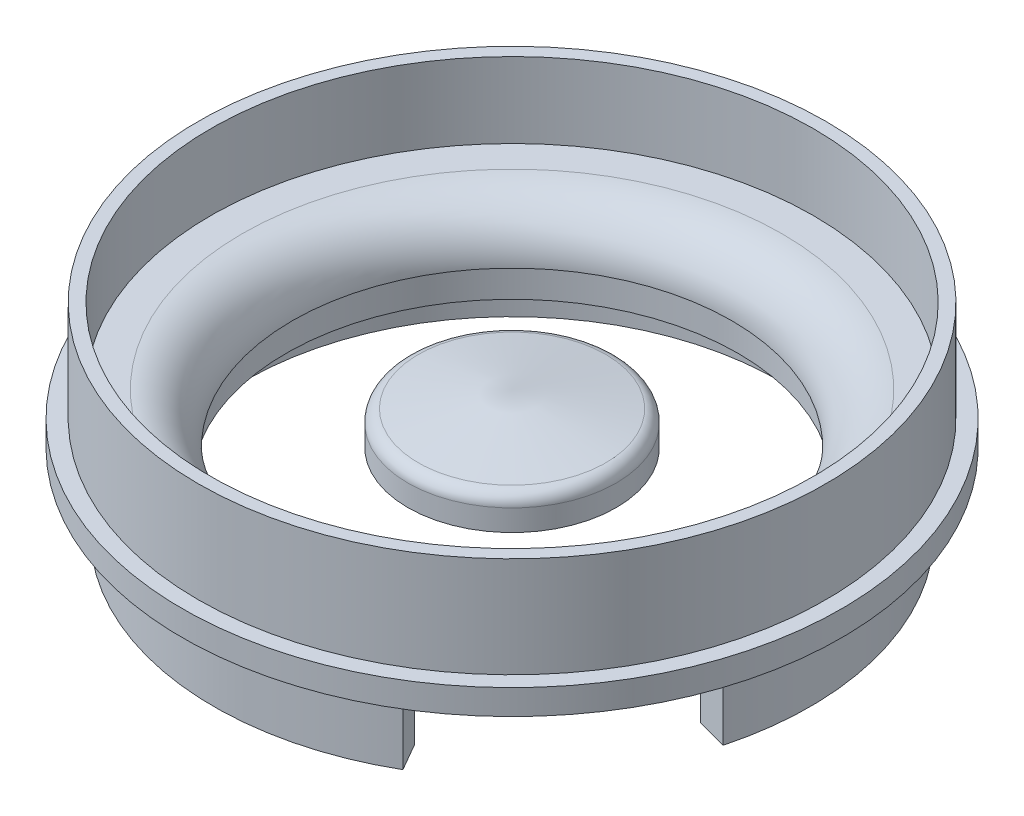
ISO-10303-21;
HEADER;
FILE_DESCRIPTION(('STEP AP214'),'2;1');
FILE_NAME('part.step','',(''),(''),'','','');
FILE_SCHEMA(('AUTOMOTIVE_DESIGN { 1 0 10303 214 1 1 1 1 }'));
ENDSEC;
DATA;
#1=APPLICATION_CONTEXT('core data for automotive mechanical design processes');
#2=APPLICATION_PROTOCOL_DEFINITION('international standard','automotive_design',2000,#1);
#3=PRODUCT_CONTEXT('',#1,'mechanical');
#4=PRODUCT('Part','Part','',(#3));
#5=PRODUCT_RELATED_PRODUCT_CATEGORY('part','',(#4));
#6=PRODUCT_DEFINITION_FORMATION('','',#4);
#7=PRODUCT_DEFINITION_CONTEXT('part definition',#1,'design');
#8=PRODUCT_DEFINITION('design','',#6,#7);
#9=PRODUCT_DEFINITION_SHAPE('','',#8);
#10=(LENGTH_UNIT() NAMED_UNIT(*) SI_UNIT(.MILLI.,.METRE.));
#11=(NAMED_UNIT(*) PLANE_ANGLE_UNIT() SI_UNIT($,.RADIAN.));
#12=(NAMED_UNIT(*) SI_UNIT($,.STERADIAN.) SOLID_ANGLE_UNIT());
#13=UNCERTAINTY_MEASURE_WITH_UNIT(LENGTH_MEASURE(1.E-05),#10,'distance_accuracy_value','');
#14=(GEOMETRIC_REPRESENTATION_CONTEXT(3) GLOBAL_UNCERTAINTY_ASSIGNED_CONTEXT((#13)) GLOBAL_UNIT_ASSIGNED_CONTEXT((#10,
#11,#12)) REPRESENTATION_CONTEXT('',''));
#15=CARTESIAN_POINT('',(0.,0.,0.));
#16=DIRECTION('',(0.,0.,1.));
#17=DIRECTION('',(1.,0.,0.));
#18=AXIS2_PLACEMENT_3D('',#15,#16,#17);
#19=CARTESIAN_POINT('',(0.,-12.,0.));
#20=DIRECTION('',(0.,1.,0.));
#21=DIRECTION('',(0.,0.,1.));
#22=AXIS2_PLACEMENT_3D('',#19,#20,#21);
#23=CYLINDRICAL_SURFACE('',#22,42.5);
#24=CARTESIAN_POINT('',(0.,0.,0.));
#25=DIRECTION('',(0.,-1.,0.));
#26=DIRECTION('',(0.,0.,-1.));
#27=AXIS2_PLACEMENT_3D('',#24,#25,#26);
#28=CIRCLE('',#27,42.5);
#29=CARTESIAN_POINT('',(21.2499999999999,0.,36.8060796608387));
#30=VERTEX_POINT('',#29);
#31=CARTESIAN_POINT('',(41.0518476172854,0.,10.9998094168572));
#32=VERTEX_POINT('',#31);
#33=EDGE_CURVE('E119',#30,#32,#28,.T.);
#34=ORIENTED_EDGE('',*,*,#33,.F.);
#35=DIRECTION('',(0.,1.,0.));
#36=VECTOR('',#35,1.);
#37=CARTESIAN_POINT('',(21.2499999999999,-12.,36.8060796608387));
#38=LINE('',#37,#36);
#39=CARTESIAN_POINT('',(21.2499999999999,-12.,36.8060796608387));
#40=VERTEX_POINT('',#39);
#41=EDGE_CURVE('E12',#40,#30,#38,.T.);
#42=ORIENTED_EDGE('',*,*,#41,.F.);
#43=CARTESIAN_POINT('',(0.,-12.,0.));
#44=DIRECTION('',(0.,-1.,0.));
#45=DIRECTION('',(0.,0.,-1.));
#46=AXIS2_PLACEMENT_3D('',#43,#44,#45);
#47=CIRCLE('',#46,42.5);
#48=CARTESIAN_POINT('',(41.0518476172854,-12.,10.9998094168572));
#49=VERTEX_POINT('',#48);
#50=EDGE_CURVE('E102',#40,#49,#47,.T.);
#51=ORIENTED_EDGE('',*,*,#50,.T.);
#52=DIRECTION('',(0.,1.,0.));
#53=VECTOR('',#52,1.);
#54=CARTESIAN_POINT('',(41.0518476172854,-12.,10.9998094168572));
#55=LINE('',#54,#53);
#56=EDGE_CURVE('E70',#49,#32,#55,.T.);
#57=ORIENTED_EDGE('',*,*,#56,.T.);
#58=EDGE_LOOP('',(#34,#42,#51,#57));
#59=FACE_BOUND('',#58,.T.);
#60=CARTESIAN_POINT('',(-23.3782669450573,-5.5,35.4923461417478));
#61=CARTESIAN_POINT('',(-23.3782620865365,-5.35970430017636,35.4923500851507));
#62=CARTESIAN_POINT('',(-23.3683567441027,-5.2193099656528,35.4988799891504));
#63=CARTESIAN_POINT('',(-23.3289550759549,-4.94239677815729,35.5247855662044));
#64=CARTESIAN_POINT('',(-23.2994358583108,-4.80588264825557,35.5441762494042));
#65=CARTESIAN_POINT('',(-23.2215701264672,-4.54078114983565,35.5950956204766));
#66=CARTESIAN_POINT('',(-23.1732334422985,-4.41218968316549,35.6266179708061));
#67=CARTESIAN_POINT('',(-23.0589886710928,-4.1665382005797,35.7006674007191));
#68=CARTESIAN_POINT('',(-22.9930846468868,-4.0494755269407,35.7431919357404));
#69=CARTESIAN_POINT('',(-22.8453149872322,-3.83001286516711,35.8378189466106));
#70=CARTESIAN_POINT('',(-22.7634305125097,-3.72763043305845,35.8899327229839));
#71=CARTESIAN_POINT('',(-22.5858849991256,-3.54058460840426,36.0019276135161));
#72=CARTESIAN_POINT('',(-22.4902233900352,-3.45592194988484,36.0618090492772));
#73=CARTESIAN_POINT('',(-22.2875869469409,-3.30666669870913,36.1873964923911));
#74=CARTESIAN_POINT('',(-22.1806041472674,-3.24208836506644,36.2531065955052));
#75=CARTESIAN_POINT('',(-21.9582707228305,-3.1349262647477,36.3882020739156));
#76=CARTESIAN_POINT('',(-21.8429201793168,-3.09234228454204,36.4575874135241));
#77=CARTESIAN_POINT('',(-21.6071670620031,-3.03042567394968,36.5978019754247));
#78=CARTESIAN_POINT('',(-21.4867705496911,-3.01106592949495,36.668629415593));
#79=CARTESIAN_POINT('',(-21.2441768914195,-2.99606362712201,36.8097084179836));
#80=CARTESIAN_POINT('',(-21.1219797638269,-3.0004208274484,36.8799599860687));
#81=CARTESIAN_POINT('',(-20.8794241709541,-3.03270632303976,37.0178212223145));
#82=CARTESIAN_POINT('',(-20.7590636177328,-3.06060544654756,37.0854340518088));
#83=CARTESIAN_POINT('',(-20.5235062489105,-3.13913758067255,37.2163117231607));
#84=CARTESIAN_POINT('',(-20.4083094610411,-3.18977071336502,37.2795765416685));
#85=CARTESIAN_POINT('',(-20.1863853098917,-3.31236668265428,37.40021159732));
#86=CARTESIAN_POINT('',(-20.0796632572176,-3.38434276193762,37.4575781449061));
#87=CARTESIAN_POINT('',(-19.877933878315,-3.5475718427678,37.5650213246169));
#88=CARTESIAN_POINT('',(-19.7829266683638,-3.63882503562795,37.6150978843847));
#89=CARTESIAN_POINT('',(-19.6073468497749,-3.8381828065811,37.7069198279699));
#90=CARTESIAN_POINT('',(-19.5267963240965,-3.94631270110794,37.7486524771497));
#91=CARTESIAN_POINT('',(-19.3827640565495,-4.17626569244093,37.8228111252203));
#92=CARTESIAN_POINT('',(-19.3192823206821,-4.29808879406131,37.8552371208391));
#93=CARTESIAN_POINT('',(-19.2113459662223,-4.55198603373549,37.91012887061));
#94=CARTESIAN_POINT('',(-19.16689226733,-4.68406066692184,37.932594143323));
#95=CARTESIAN_POINT('',(-19.0984066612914,-4.954704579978,37.967121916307));
#96=CARTESIAN_POINT('',(-19.0743745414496,-5.09327379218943,37.9791845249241));
#97=CARTESIAN_POINT('',(-19.0475091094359,-5.37275112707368,37.9926654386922));
#98=CARTESIAN_POINT('',(-19.0446440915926,-5.51365543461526,37.9940996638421));
#99=CARTESIAN_POINT('',(-19.0601194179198,-5.79399858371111,37.986338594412));
#100=CARTESIAN_POINT('',(-19.0784596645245,-5.933437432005,37.9771433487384));
#101=CARTESIAN_POINT('',(-19.1357476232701,-6.20679156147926,37.9483093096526));
#102=CARTESIAN_POINT('',(-19.1746807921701,-6.34071066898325,37.9286778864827));
#103=CARTESIAN_POINT('',(-19.2719308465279,-6.5993418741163,37.8793563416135));
#104=CARTESIAN_POINT('',(-19.3302478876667,-6.72405389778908,37.8496661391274));
#105=CARTESIAN_POINT('',(-19.4645460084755,-6.96089358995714,37.7807772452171));
#106=CARTESIAN_POINT('',(-19.540548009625,-7.07300611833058,37.7415672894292));
#107=CARTESIAN_POINT('',(-19.7078569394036,-7.28131191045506,37.6544717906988));
#108=CARTESIAN_POINT('',(-19.7991640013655,-7.3775050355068,37.6065861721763));
#109=CARTESIAN_POINT('',(-19.994449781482,-7.55136089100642,37.5031222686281));
#110=CARTESIAN_POINT('',(-20.0984439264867,-7.62900071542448,37.447534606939));
#111=CARTESIAN_POINT('',(-20.3159076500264,-7.76338936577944,37.330003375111));
#112=CARTESIAN_POINT('',(-20.4293771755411,-7.82013830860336,37.2680598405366));
#113=CARTESIAN_POINT('',(-20.6623662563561,-7.91109439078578,37.1393902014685));
#114=CARTESIAN_POINT('',(-20.7818818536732,-7.94531607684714,37.0726672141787));
#115=CARTESIAN_POINT('',(-21.0235488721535,-7.99029383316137,36.9361563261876));
#116=CARTESIAN_POINT('',(-21.1457002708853,-8.00105010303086,36.866368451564));
#117=CARTESIAN_POINT('',(-21.3889480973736,-7.998789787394,36.7257757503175));
#118=CARTESIAN_POINT('',(-21.5100458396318,-7.98580907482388,36.6549726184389));
#119=CARTESIAN_POINT('',(-21.7479670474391,-7.93651757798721,36.514312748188));
#120=CARTESIAN_POINT('',(-21.8647905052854,-7.90020675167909,36.4444560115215));
#121=CARTESIAN_POINT('',(-22.0909398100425,-7.80529364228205,36.3078207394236));
#122=CARTESIAN_POINT('',(-22.2002656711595,-7.74669140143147,36.24104219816));
#123=CARTESIAN_POINT('',(-22.4084623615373,-7.60886425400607,36.1126818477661));
#124=CARTESIAN_POINT('',(-22.5073334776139,-7.5296399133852,36.0510998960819));
#125=CARTESIAN_POINT('',(-22.6921314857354,-7.35268585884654,35.9350679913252));
#126=CARTESIAN_POINT('',(-22.7780400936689,-7.25493043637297,35.8806281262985));
#127=CARTESIAN_POINT('',(-22.9345156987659,-7.04371942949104,35.7808136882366));
#128=CARTESIAN_POINT('',(-23.0050789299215,-6.93026000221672,35.7354413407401));
#129=CARTESIAN_POINT('',(-23.129075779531,-6.69074489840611,35.6553127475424));
#130=CARTESIAN_POINT('',(-23.1824895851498,-6.56467487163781,35.6205687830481));
#131=CARTESIAN_POINT('',(-23.2706477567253,-6.3037135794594,35.5630390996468));
#132=CARTESIAN_POINT('',(-23.3054140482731,-6.16883288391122,35.5402393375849));
#133=CARTESIAN_POINT('',(-23.3463304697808,-5.94426906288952,35.5133663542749));
#134=CARTESIAN_POINT('',(-23.3582925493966,-5.85603848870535,35.5054962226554));
#135=CARTESIAN_POINT('',(-23.3742623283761,-5.67855192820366,35.4949848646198));
#136=CARTESIAN_POINT('',(-23.3782700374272,-5.58929594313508,35.4923436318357));
#137=CARTESIAN_POINT('',(-23.3782669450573,-5.5,35.4923461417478));
#138=B_SPLINE_CURVE_WITH_KNOTS('',3,(#60,#61,#62,#63,#64,#65,#66,#67,#68,#69,#70,#71,#72,#73,
#74,#75,#76,#77,#78,#79,#80,#81,#82,#83,#84,#85,#86,#87,#88,#89,#90,#91,#92,#93,#94,#95,#96,#97,
#98,#99,#100,#101,#102,#103,#104,#105,#106,#107,#108,#109,#110,#111,#112,#113,#114,#115,#116,
#117,#118,#119,#120,#121,#122,#123,#124,#125,#126,#127,#128,#129,#130,#131,#132,#133,#134,#135,
#136,#137),.UNSPECIFIED.,.T.,.F.,(4,2,2,2,2,2,2,2,2,2,2,2,2,2,2,2,2,2,2,2,2,2,2,2,2,2,2,2,2,2,2,
2,2,2,2,2,2,2,4),(0.,0.420561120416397,0.841613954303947,1.26244712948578,1.68318306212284,
2.10441802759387,2.52567043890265,2.94722124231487,3.36876795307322,3.78982203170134,
4.21087181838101,4.63140062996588,5.05193169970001,5.47272424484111,5.89352096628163,
6.31495509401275,6.73638936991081,7.15784401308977,7.57929426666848,8.00011311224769,
8.42093002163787,8.84145013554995,9.26197362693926,9.68299715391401,10.104024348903,
10.5255686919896,10.9471106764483,11.3683801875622,11.7896461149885,12.2102759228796,
12.6309064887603,13.0515362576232,13.4721544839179,13.8933605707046,14.3146699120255,
14.7364642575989,15.1577615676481,15.4254422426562,15.6931225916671),.UNSPECIFIED.);
#139=CARTESIAN_POINT('',(-23.3782669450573,-5.5,35.4923461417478));
#140=VERTEX_POINT('',#139);
#141=EDGE_CURVE('E121',#140,#140,#138,.T.);
#142=ORIENTED_EDGE('',*,*,#141,.F.);
#143=EDGE_LOOP('',(#142));
#144=FACE_BOUND('',#143,.T.);
#145=CARTESIAN_POINT('',(23.3782669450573,-5.5,-35.4923461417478));
#146=CARTESIAN_POINT('',(23.3782620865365,-5.64029569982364,-35.4923500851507));
#147=CARTESIAN_POINT('',(23.3683567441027,-5.78069003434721,-35.4988799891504));
#148=CARTESIAN_POINT('',(23.3289550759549,-6.05760322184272,-35.5247855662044));
#149=CARTESIAN_POINT('',(23.2994358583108,-6.19411735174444,-35.5441762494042));
#150=CARTESIAN_POINT('',(23.2215701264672,-6.45921885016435,-35.5950956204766));
#151=CARTESIAN_POINT('',(23.1732334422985,-6.58781031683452,-35.6266179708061));
#152=CARTESIAN_POINT('',(23.0589886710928,-6.8334617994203,-35.7006674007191));
#153=CARTESIAN_POINT('',(22.9930846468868,-6.9505244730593,-35.7431919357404));
#154=CARTESIAN_POINT('',(22.8453149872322,-7.16998713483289,-35.8378189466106));
#155=CARTESIAN_POINT('',(22.7634305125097,-7.27236956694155,-35.8899327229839));
#156=CARTESIAN_POINT('',(22.5858849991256,-7.45941539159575,-36.0019276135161));
#157=CARTESIAN_POINT('',(22.4902233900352,-7.54407805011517,-36.0618090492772));
#158=CARTESIAN_POINT('',(22.2875869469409,-7.69333330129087,-36.1873964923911));
#159=CARTESIAN_POINT('',(22.1806041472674,-7.75791163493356,-36.2531065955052));
#160=CARTESIAN_POINT('',(21.9582707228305,-7.8650737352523,-36.3882020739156));
#161=CARTESIAN_POINT('',(21.8429201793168,-7.90765771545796,-36.457587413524));
#162=CARTESIAN_POINT('',(21.6071670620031,-7.96957432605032,-36.5978019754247));
#163=CARTESIAN_POINT('',(21.4867705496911,-7.98893407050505,-36.668629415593));
#164=CARTESIAN_POINT('',(21.2441768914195,-8.003936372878,-36.8097084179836));
#165=CARTESIAN_POINT('',(21.1219797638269,-7.99957917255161,-36.8799599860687));
#166=CARTESIAN_POINT('',(20.8794241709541,-7.96729367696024,-37.0178212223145));
#167=CARTESIAN_POINT('',(20.7590636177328,-7.93939455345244,-37.0854340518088));
#168=CARTESIAN_POINT('',(20.5235062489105,-7.86086241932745,-37.2163117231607));
#169=CARTESIAN_POINT('',(20.4083094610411,-7.81022928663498,-37.2795765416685));
#170=CARTESIAN_POINT('',(20.1863853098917,-7.68763331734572,-37.40021159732));
#171=CARTESIAN_POINT('',(20.0796632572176,-7.61565723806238,-37.4575781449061));
#172=CARTESIAN_POINT('',(19.877933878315,-7.4524281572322,-37.5650213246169));
#173=CARTESIAN_POINT('',(19.7829266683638,-7.36117496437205,-37.6150978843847));
#174=CARTESIAN_POINT('',(19.607346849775,-7.16181719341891,-37.7069198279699));
#175=CARTESIAN_POINT('',(19.5267963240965,-7.05368729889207,-37.7486524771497));
#176=CARTESIAN_POINT('',(19.3827640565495,-6.82373430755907,-37.8228111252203));
#177=CARTESIAN_POINT('',(19.3192823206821,-6.70191120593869,-37.8552371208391));
#178=CARTESIAN_POINT('',(19.2113459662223,-6.44801396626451,-37.91012887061));
#179=CARTESIAN_POINT('',(19.16689226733,-6.31593933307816,-37.932594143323));
#180=CARTESIAN_POINT('',(19.0984066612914,-6.045295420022,-37.967121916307));
#181=CARTESIAN_POINT('',(19.0743745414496,-5.90672620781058,-37.9791845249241));
#182=CARTESIAN_POINT('',(19.0475091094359,-5.62724887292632,-37.9926654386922));
#183=CARTESIAN_POINT('',(19.0446440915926,-5.48634456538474,-37.9940996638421));
#184=CARTESIAN_POINT('',(19.0601194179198,-5.20600141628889,-37.986338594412));
#185=CARTESIAN_POINT('',(19.0784596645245,-5.066562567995,-37.9771433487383));
#186=CARTESIAN_POINT('',(19.1357476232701,-4.79320843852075,-37.9483093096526));
#187=CARTESIAN_POINT('',(19.1746807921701,-4.65928933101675,-37.9286778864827));
#188=CARTESIAN_POINT('',(19.2719308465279,-4.40065812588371,-37.8793563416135));
#189=CARTESIAN_POINT('',(19.3302478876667,-4.27594610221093,-37.8496661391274));
#190=CARTESIAN_POINT('',(19.4645460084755,-4.03910641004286,-37.7807772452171));
#191=CARTESIAN_POINT('',(19.540548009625,-3.92699388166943,-37.7415672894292));
#192=CARTESIAN_POINT('',(19.7078569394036,-3.71868808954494,-37.6544717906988));
#193=CARTESIAN_POINT('',(19.7991640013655,-3.6224949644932,-37.6065861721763));
#194=CARTESIAN_POINT('',(19.994449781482,-3.44863910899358,-37.5031222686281));
#195=CARTESIAN_POINT('',(20.0984439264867,-3.37099928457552,-37.447534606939));
#196=CARTESIAN_POINT('',(20.3159076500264,-3.23661063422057,-37.330003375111));
#197=CARTESIAN_POINT('',(20.4293771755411,-3.17986169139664,-37.2680598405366));
#198=CARTESIAN_POINT('',(20.6623662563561,-3.08890560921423,-37.1393902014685));
#199=CARTESIAN_POINT('',(20.7818818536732,-3.05468392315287,-37.0726672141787));
#200=CARTESIAN_POINT('',(21.0235488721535,-3.00970616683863,-36.9361563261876));
#201=CARTESIAN_POINT('',(21.1457002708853,-2.99894989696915,-36.866368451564));
#202=CARTESIAN_POINT('',(21.3889480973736,-3.00121021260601,-36.7257757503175));
#203=CARTESIAN_POINT('',(21.5100458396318,-3.01419092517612,-36.6549726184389));
#204=CARTESIAN_POINT('',(21.7479670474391,-3.0634824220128,-36.514312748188));
#205=CARTESIAN_POINT('',(21.8647905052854,-3.09979324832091,-36.4444560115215));
#206=CARTESIAN_POINT('',(22.0909398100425,-3.19470635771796,-36.3078207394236));
#207=CARTESIAN_POINT('',(22.2002656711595,-3.25330859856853,-36.24104219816));
#208=CARTESIAN_POINT('',(22.4084623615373,-3.39113574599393,-36.1126818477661));
#209=CARTESIAN_POINT('',(22.5073334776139,-3.4703600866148,-36.0510998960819));
#210=CARTESIAN_POINT('',(22.6921314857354,-3.64731414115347,-35.9350679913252));
#211=CARTESIAN_POINT('',(22.7780400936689,-3.74506956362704,-35.8806281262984));
#212=CARTESIAN_POINT('',(22.9345156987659,-3.95628057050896,-35.7808136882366));
#213=CARTESIAN_POINT('',(23.0050789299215,-4.06973999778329,-35.7354413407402));
#214=CARTESIAN_POINT('',(23.129075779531,-4.3092551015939,-35.6553127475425));
#215=CARTESIAN_POINT('',(23.1824895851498,-4.4353251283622,-35.6205687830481));
#216=CARTESIAN_POINT('',(23.2706477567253,-4.69628642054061,-35.5630390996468));
#217=CARTESIAN_POINT('',(23.3054140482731,-4.83116711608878,-35.5402393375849));
#218=CARTESIAN_POINT('',(23.3463304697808,-5.05573093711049,-35.5133663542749));
#219=CARTESIAN_POINT('',(23.3582925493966,-5.14396151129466,-35.5054962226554));
#220=CARTESIAN_POINT('',(23.3742623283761,-5.32144807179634,-35.4949848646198));
#221=CARTESIAN_POINT('',(23.3782700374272,-5.41070405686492,-35.4923436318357));
#222=CARTESIAN_POINT('',(23.3782669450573,-5.5,-35.4923461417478));
#223=B_SPLINE_CURVE_WITH_KNOTS('',3,(#145,#146,#147,#148,#149,#150,#151,#152,#153,#154,#155,
#156,#157,#158,#159,#160,#161,#162,#163,#164,#165,#166,#167,#168,#169,#170,#171,#172,#173,#174,
#175,#176,#177,#178,#179,#180,#181,#182,#183,#184,#185,#186,#187,#188,#189,#190,#191,#192,#193,
#194,#195,#196,#197,#198,#199,#200,#201,#202,#203,#204,#205,#206,#207,#208,#209,#210,#211,#212,
#213,#214,#215,#216,#217,#218,#219,#220,#221,#222),.UNSPECIFIED.,.T.,.F.,(4,2,2,2,2,2,2,2,2,2,2,
2,2,2,2,2,2,2,2,2,2,2,2,2,2,2,2,2,2,2,2,2,2,2,2,2,2,2,4),(0.,0.420561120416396,
0.841613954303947,1.26244712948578,1.68318306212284,2.10441802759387,2.52567043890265,
2.94722124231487,3.36876795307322,3.78982203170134,4.21087181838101,4.63140062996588,
5.05193169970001,5.47272424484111,5.89352096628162,6.31495509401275,6.73638936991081,
7.15784401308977,7.57929426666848,8.0001131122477,8.42093002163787,8.84145013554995,
9.26197362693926,9.68299715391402,10.104024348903,10.5255686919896,10.9471106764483,
11.3683801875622,11.7896461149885,12.2102759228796,12.6309064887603,13.0515362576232,
13.4721544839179,13.8933605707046,14.3146699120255,14.7364642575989,15.1577615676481,
15.4254422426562,15.6931225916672),.UNSPECIFIED.);
#224=CARTESIAN_POINT('',(23.3782669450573,-5.5,-35.4923461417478));
#225=VERTEX_POINT('',#224);
#226=EDGE_CURVE('E135',#225,#225,#223,.T.);
#227=ORIENTED_EDGE('',*,*,#226,.T.);
#228=EDGE_LOOP('',(#227));
#229=FACE_BOUND('',#228,.T.);
#230=ADVANCED_FACE('F46',(#59,#144,#229),#23,.F.);
#231=CARTESIAN_POINT('',(0.,-12.,0.));
#232=DIRECTION('',(0.,1.,0.));
#233=DIRECTION('',(0.,0.,1.));
#234=AXIS2_PLACEMENT_3D('',#231,#232,#233);
#235=CYLINDRICAL_SURFACE('',#234,47.5);
#236=CARTESIAN_POINT('',(-25.8821459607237,-5.5,39.8291918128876));
#237=CARTESIAN_POINT('',(-25.8821410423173,-5.35967828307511,39.8291956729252));
#238=CARTESIAN_POINT('',(-25.872194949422,-5.21925729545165,39.8356637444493));
#239=CARTESIAN_POINT('',(-25.8326335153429,-4.94228974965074,39.8613293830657));
#240=CARTESIAN_POINT('',(-25.8029950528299,-4.80574794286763,39.8805419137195));
#241=CARTESIAN_POINT('',(-25.7248231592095,-4.5405909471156,39.9310108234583));
#242=CARTESIAN_POINT('',(-25.676299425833,-4.41197172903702,39.9622610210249));
#243=CARTESIAN_POINT('',(-25.5616314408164,-4.16627023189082,40.035704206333));
#244=CARTESIAN_POINT('',(-25.4954913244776,-4.04918525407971,40.0778946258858));
#245=CARTESIAN_POINT('',(-25.3472407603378,-3.82971166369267,40.1718193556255));
#246=CARTESIAN_POINT('',(-25.2651148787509,-3.72733742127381,40.2235628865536));
#247=CARTESIAN_POINT('',(-25.0870961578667,-3.54031395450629,40.3348311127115));
#248=CARTESIAN_POINT('',(-24.991202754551,-3.45566545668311,40.3943561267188));
#249=CARTESIAN_POINT('',(-24.7881540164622,-3.30645581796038,40.5192746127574));
#250=CARTESIAN_POINT('',(-24.6809923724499,-3.24190601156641,40.5846713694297));
#251=CARTESIAN_POINT('',(-24.4583622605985,-3.13479879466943,40.7192266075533));
#252=CARTESIAN_POINT('',(-24.3428938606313,-3.09224120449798,40.7883850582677));
#253=CARTESIAN_POINT('',(-24.1069516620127,-3.03036482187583,40.9282746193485));
#254=CARTESIAN_POINT('',(-23.9864826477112,-3.0110243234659,40.9990041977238));
#255=CARTESIAN_POINT('',(-23.7438211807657,-2.99606413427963,41.1400126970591));
#256=CARTESIAN_POINT('',(-23.6216287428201,-3.00044424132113,41.2102916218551));
#257=CARTESIAN_POINT('',(-23.3791265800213,-3.03278293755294,41.3483481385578));
#258=CARTESIAN_POINT('',(-23.2588151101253,-3.06071816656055,41.4161281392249));
#259=CARTESIAN_POINT('',(-23.0234232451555,-3.13933790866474,41.5474446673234));
#260=CARTESIAN_POINT('',(-22.9083428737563,-3.19002252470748,41.6109811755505));
#261=CARTESIAN_POINT('',(-22.6867197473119,-3.31272889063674,41.7322264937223));
#262=CARTESIAN_POINT('',(-22.5801812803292,-3.3847612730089,41.7899323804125));
#263=CARTESIAN_POINT('',(-22.3788538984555,-3.54811067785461,41.8980903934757));
#264=CARTESIAN_POINT('',(-22.2840650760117,-3.6394278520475,41.9485424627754));
#265=CARTESIAN_POINT('',(-22.1089629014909,-3.83888671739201,42.0410942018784));
#266=CARTESIAN_POINT('',(-22.0286672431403,-3.94704867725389,42.0831836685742));
#267=CARTESIAN_POINT('',(-21.8851251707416,-4.17705562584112,42.1580107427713));
#268=CARTESIAN_POINT('',(-21.8218787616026,-4.29890061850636,42.1907483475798));
#269=CARTESIAN_POINT('',(-21.7143702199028,-4.55282735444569,42.2461809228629));
#270=CARTESIAN_POINT('',(-21.6701087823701,-4.68490947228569,42.2688755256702));
#271=CARTESIAN_POINT('',(-21.6019435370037,-4.9555554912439,42.3037529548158));
#272=CARTESIAN_POINT('',(-21.5780395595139,-5.09411933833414,42.315935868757));
#273=CARTESIAN_POINT('',(-21.5513496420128,-5.37361752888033,42.3295352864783));
#274=CARTESIAN_POINT('',(-21.54853840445,-5.51454882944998,42.3309646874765));
#275=CARTESIAN_POINT('',(-21.5640548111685,-5.79493784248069,42.3230624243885));
#276=CARTESIAN_POINT('',(-21.5823823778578,-5.93439556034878,42.3137307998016));
#277=CARTESIAN_POINT('',(-21.6395894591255,-6.2077989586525,42.2845029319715));
#278=CARTESIAN_POINT('',(-21.6784574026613,-6.34174769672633,42.2646126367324));
#279=CARTESIAN_POINT('',(-21.7755371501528,-6.60042504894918,42.2146768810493));
#280=CARTESIAN_POINT('',(-21.8337490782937,-6.72515360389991,42.1846313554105));
#281=CARTESIAN_POINT('',(-21.9677990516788,-6.96198042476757,42.1149794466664));
#282=CARTESIAN_POINT('',(-22.0436538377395,-7.0740665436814,42.0753639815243));
#283=CARTESIAN_POINT('',(-22.2106587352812,-7.28230455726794,41.9874447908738));
#284=CARTESIAN_POINT('',(-22.3018089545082,-7.37845633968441,41.9391410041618));
#285=CARTESIAN_POINT('',(-22.4967671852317,-7.55219167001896,41.8348858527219));
#286=CARTESIAN_POINT('',(-22.6005875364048,-7.62975689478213,41.7789270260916));
#287=CARTESIAN_POINT('',(-22.8177284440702,-7.76399203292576,41.6607312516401));
#288=CARTESIAN_POINT('',(-22.9310489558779,-7.82066204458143,41.5984943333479));
#289=CARTESIAN_POINT('',(-23.1637974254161,-7.91146609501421,41.46934021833));
#290=CARTESIAN_POINT('',(-23.2832221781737,-7.94561183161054,41.4024254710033));
#291=CARTESIAN_POINT('',(-23.5247642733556,-7.99043636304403,41.2656602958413));
#292=CARTESIAN_POINT('',(-23.6468815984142,-8.00111530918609,41.1958098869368));
#293=CARTESIAN_POINT('',(-23.8901611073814,-7.99870168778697,41.0552057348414));
#294=CARTESIAN_POINT('',(-24.0113242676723,-7.98563784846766,40.9844531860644));
#295=CARTESIAN_POINT('',(-24.2494339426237,-7.93616891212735,40.8440211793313));
#296=CARTESIAN_POINT('',(-24.3663804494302,-7.89976377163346,40.774341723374));
#297=CARTESIAN_POINT('',(-24.5928206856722,-7.80465165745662,40.6381672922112));
#298=CARTESIAN_POINT('',(-24.7023143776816,-7.74594457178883,40.5716723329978));
#299=CARTESIAN_POINT('',(-24.9108688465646,-7.60789977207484,40.4439560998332));
#300=CARTESIAN_POINT('',(-25.0099299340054,-7.52856267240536,40.3827346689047));
#301=CARTESIAN_POINT('',(-25.1950763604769,-7.35140619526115,40.267481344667));
#302=CARTESIAN_POINT('',(-25.2811473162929,-7.25356659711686,40.213457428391));
#303=CARTESIAN_POINT('',(-25.4379261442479,-7.0421994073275,40.1144678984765));
#304=CARTESIAN_POINT('',(-25.5086302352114,-6.92866796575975,40.069504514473));
#305=CARTESIAN_POINT('',(-25.6328561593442,-6.6890427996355,39.9901505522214));
#306=CARTESIAN_POINT('',(-25.6863605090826,-6.56293646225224,39.9557707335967));
#307=CARTESIAN_POINT('',(-25.774643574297,-6.30192589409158,39.8988788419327));
#308=CARTESIAN_POINT('',(-25.809444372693,-6.16703225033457,39.8763527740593));
#309=CARTESIAN_POINT('',(-25.8503116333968,-5.94275244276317,39.8498647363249));
#310=CARTESIAN_POINT('',(-25.8622353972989,-5.85481843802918,39.842124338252));
#311=CARTESIAN_POINT('',(-25.8781541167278,-5.6779362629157,39.8317866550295));
#312=CARTESIAN_POINT('',(-25.882149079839,-5.5889880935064,39.8291893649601));
#313=CARTESIAN_POINT('',(-25.8821459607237,-5.5,39.8291918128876));
#314=B_SPLINE_CURVE_WITH_KNOTS('',3,(#236,#237,#238,#239,#240,#241,#242,#243,#244,#245,#246,
#247,#248,#249,#250,#251,#252,#253,#254,#255,#256,#257,#258,#259,#260,#261,#262,#263,#264,#265,
#266,#267,#268,#269,#270,#271,#272,#273,#274,#275,#276,#277,#278,#279,#280,#281,#282,#283,#284,
#285,#286,#287,#288,#289,#290,#291,#292,#293,#294,#295,#296,#297,#298,#299,#300,#301,#302,#303,
#304,#305,#306,#307,#308,#309,#310,#311,#312,#313),.UNSPECIFIED.,.T.,.F.,(4,2,2,2,2,2,2,2,2,2,2,
2,2,2,2,2,2,2,2,2,2,2,2,2,2,2,2,2,2,2,2,2,2,2,2,2,2,2,4),(0.,0.42064030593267,0.841775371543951,
1.26269446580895,1.68351483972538,2.10474353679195,2.52598949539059,2.94747258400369,
3.36895222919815,3.79003751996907,4.21111922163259,4.63178381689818,5.05245031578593,
5.47332668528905,5.89420636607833,6.31559644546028,6.7369866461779,7.15839227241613,
7.57979438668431,8.00069101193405,8.42158609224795,8.84224432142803,9.26290525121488,
9.68396697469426,10.105031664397,10.5265097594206,10.9479858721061,11.3692429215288,
11.7904972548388,12.2112422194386,12.6319879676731,13.052735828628,13.4734711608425,
13.8946689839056,14.3159703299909,14.7376985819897,15.1589278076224,15.4256863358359,
15.6924446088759),.UNSPECIFIED.);
#315=CARTESIAN_POINT('',(-25.8821459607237,-5.5,39.8291918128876));
#316=VERTEX_POINT('',#315);
#317=EDGE_CURVE('E129',#316,#316,#314,.T.);
#318=ORIENTED_EDGE('',*,*,#317,.T.);
#319=EDGE_LOOP('',(#318));
#320=FACE_BOUND('',#319,.T.);
#321=CARTESIAN_POINT('',(0.,0.,0.));
#322=DIRECTION('',(0.,-1.,0.));
#323=DIRECTION('',(0.,0.,-1.));
#324=AXIS2_PLACEMENT_3D('',#321,#322,#323);
#325=CIRCLE('',#324,47.5);
#326=CARTESIAN_POINT('',(23.7499999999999,0.,41.1362066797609));
#327=VERTEX_POINT('',#326);
#328=CARTESIAN_POINT('',(45.8814767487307,0.,12.2939046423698));
#329=VERTEX_POINT('',#328);
#330=EDGE_CURVE('E123',#327,#329,#325,.T.);
#331=ORIENTED_EDGE('',*,*,#330,.T.);
#332=DIRECTION('',(0.,1.,0.));
#333=VECTOR('',#332,1.);
#334=CARTESIAN_POINT('',(45.8814767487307,-12.,12.2939046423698));
#335=LINE('',#334,#333);
#336=CARTESIAN_POINT('',(45.8814767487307,-12.,12.2939046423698));
#337=VERTEX_POINT('',#336);
#338=EDGE_CURVE('E84',#337,#329,#335,.T.);
#339=ORIENTED_EDGE('',*,*,#338,.F.);
#340=CARTESIAN_POINT('',(0.,-12.,0.));
#341=DIRECTION('',(0.,-1.,0.));
#342=DIRECTION('',(0.,0.,-1.));
#343=AXIS2_PLACEMENT_3D('',#340,#341,#342);
#344=CIRCLE('',#343,47.5);
#345=CARTESIAN_POINT('',(23.7499999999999,-12.,41.1362066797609));
#346=VERTEX_POINT('',#345);
#347=EDGE_CURVE('E101',#346,#337,#344,.T.);
#348=ORIENTED_EDGE('',*,*,#347,.F.);
#349=DIRECTION('',(0.,1.,0.));
#350=VECTOR('',#349,1.);
#351=CARTESIAN_POINT('',(23.7499999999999,-12.,41.1362066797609));
#352=LINE('',#351,#350);
#353=EDGE_CURVE('E61',#346,#327,#352,.T.);
#354=ORIENTED_EDGE('',*,*,#353,.T.);
#355=EDGE_LOOP('',(#331,#339,#348,#354));
#356=FACE_BOUND('',#355,.T.);
#357=CARTESIAN_POINT('',(25.8821459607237,-5.5,-39.8291918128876));
#358=CARTESIAN_POINT('',(25.8821410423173,-5.64032171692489,-39.8291956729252));
#359=CARTESIAN_POINT('',(25.872194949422,-5.78074270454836,-39.8356637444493));
#360=CARTESIAN_POINT('',(25.8326335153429,-6.05771025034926,-39.8613293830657));
#361=CARTESIAN_POINT('',(25.8029950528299,-6.19425205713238,-39.8805419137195));
#362=CARTESIAN_POINT('',(25.7248231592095,-6.4594090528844,-39.9310108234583));
#363=CARTESIAN_POINT('',(25.676299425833,-6.58802827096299,-39.9622610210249));
#364=CARTESIAN_POINT('',(25.5616314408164,-6.83372976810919,-40.035704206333));
#365=CARTESIAN_POINT('',(25.4954913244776,-6.95081474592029,-40.0778946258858));
#366=CARTESIAN_POINT('',(25.3472407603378,-7.17028833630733,-40.1718193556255));
#367=CARTESIAN_POINT('',(25.2651148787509,-7.2726625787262,-40.2235628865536));
#368=CARTESIAN_POINT('',(25.0870961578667,-7.45968604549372,-40.3348311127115));
#369=CARTESIAN_POINT('',(24.991202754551,-7.54433454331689,-40.3943561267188));
#370=CARTESIAN_POINT('',(24.7881540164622,-7.69354418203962,-40.5192746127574));
#371=CARTESIAN_POINT('',(24.6809923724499,-7.7580939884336,-40.5846713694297));
#372=CARTESIAN_POINT('',(24.4583622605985,-7.86520120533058,-40.7192266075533));
#373=CARTESIAN_POINT('',(24.3428938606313,-7.90775879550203,-40.7883850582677));
#374=CARTESIAN_POINT('',(24.1069516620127,-7.96963517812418,-40.9282746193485));
#375=CARTESIAN_POINT('',(23.9864826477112,-7.98897567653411,-40.9990041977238));
#376=CARTESIAN_POINT('',(23.7438211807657,-8.00393586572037,-41.1400126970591));
#377=CARTESIAN_POINT('',(23.6216287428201,-7.99955575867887,-41.2102916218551));
#378=CARTESIAN_POINT('',(23.3791265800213,-7.96721706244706,-41.3483481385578));
#379=CARTESIAN_POINT('',(23.2588151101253,-7.93928183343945,-41.4161281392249));
#380=CARTESIAN_POINT('',(23.0234232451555,-7.86066209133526,-41.5474446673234));
#381=CARTESIAN_POINT('',(22.9083428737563,-7.80997747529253,-41.6109811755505));
#382=CARTESIAN_POINT('',(22.6867197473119,-7.68727110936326,-41.7322264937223));
#383=CARTESIAN_POINT('',(22.5801812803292,-7.6152387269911,-41.7899323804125));
#384=CARTESIAN_POINT('',(22.3788538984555,-7.45188932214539,-41.8980903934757));
#385=CARTESIAN_POINT('',(22.2840650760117,-7.3605721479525,-41.9485424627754));
#386=CARTESIAN_POINT('',(22.1089629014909,-7.161113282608,-42.0410942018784));
#387=CARTESIAN_POINT('',(22.0286672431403,-7.05295132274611,-42.0831836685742));
#388=CARTESIAN_POINT('',(21.8851251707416,-6.82294437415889,-42.1580107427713));
#389=CARTESIAN_POINT('',(21.8218787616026,-6.70109938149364,-42.1907483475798));
#390=CARTESIAN_POINT('',(21.7143702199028,-6.44717264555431,-42.2461809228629));
#391=CARTESIAN_POINT('',(21.6701087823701,-6.31509052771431,-42.2688755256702));
#392=CARTESIAN_POINT('',(21.6019435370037,-6.0444445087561,-42.3037529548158));
#393=CARTESIAN_POINT('',(21.5780395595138,-5.90588066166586,-42.315935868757));
#394=CARTESIAN_POINT('',(21.5513496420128,-5.62638247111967,-42.3295352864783));
#395=CARTESIAN_POINT('',(21.5485384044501,-5.48545117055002,-42.3309646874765));
#396=CARTESIAN_POINT('',(21.5640548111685,-5.20506215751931,-42.3230624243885));
#397=CARTESIAN_POINT('',(21.5823823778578,-5.06560443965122,-42.3137307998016));
#398=CARTESIAN_POINT('',(21.6395894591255,-4.79220104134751,-42.2845029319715));
#399=CARTESIAN_POINT('',(21.6784574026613,-4.65825230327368,-42.2646126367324));
#400=CARTESIAN_POINT('',(21.7755371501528,-4.39957495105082,-42.2146768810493));
#401=CARTESIAN_POINT('',(21.8337490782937,-4.27484639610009,-42.1846313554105));
#402=CARTESIAN_POINT('',(21.9677990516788,-4.03801957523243,-42.1149794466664));
#403=CARTESIAN_POINT('',(22.0436538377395,-3.9259334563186,-42.0753639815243));
#404=CARTESIAN_POINT('',(22.2106587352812,-3.71769544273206,-41.9874447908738));
#405=CARTESIAN_POINT('',(22.3018089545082,-3.62154366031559,-41.9391410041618));
#406=CARTESIAN_POINT('',(22.4967671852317,-3.44780832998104,-41.8348858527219));
#407=CARTESIAN_POINT('',(22.6005875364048,-3.37024310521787,-41.7789270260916));
#408=CARTESIAN_POINT('',(22.8177284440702,-3.23600796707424,-41.6607312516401));
#409=CARTESIAN_POINT('',(22.9310489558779,-3.17933795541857,-41.5984943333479));
#410=CARTESIAN_POINT('',(23.1637974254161,-3.0885339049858,-41.46934021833));
#411=CARTESIAN_POINT('',(23.2832221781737,-3.05438816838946,-41.4024254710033));
#412=CARTESIAN_POINT('',(23.5247642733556,-3.00956363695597,-41.2656602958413));
#413=CARTESIAN_POINT('',(23.6468815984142,-2.99888469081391,-41.1958098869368));
#414=CARTESIAN_POINT('',(23.8901611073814,-3.00129831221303,-41.0552057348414));
#415=CARTESIAN_POINT('',(24.0113242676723,-3.01436215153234,-40.9844531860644));
#416=CARTESIAN_POINT('',(24.2494339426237,-3.06383108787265,-40.8440211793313));
#417=CARTESIAN_POINT('',(24.3663804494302,-3.10023622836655,-40.774341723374));
#418=CARTESIAN_POINT('',(24.5928206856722,-3.19534834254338,-40.6381672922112));
#419=CARTESIAN_POINT('',(24.7023143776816,-3.25405542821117,-40.5716723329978));
#420=CARTESIAN_POINT('',(24.9108688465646,-3.39210022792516,-40.4439560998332));
#421=CARTESIAN_POINT('',(25.0099299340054,-3.47143732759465,-40.3827346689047));
#422=CARTESIAN_POINT('',(25.1950763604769,-3.64859380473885,-40.2674813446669));
#423=CARTESIAN_POINT('',(25.2811473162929,-3.74643340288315,-40.213457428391));
#424=CARTESIAN_POINT('',(25.4379261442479,-3.95780059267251,-40.1144678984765));
#425=CARTESIAN_POINT('',(25.5086302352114,-4.07133203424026,-40.069504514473));
#426=CARTESIAN_POINT('',(25.6328561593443,-4.31095720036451,-39.9901505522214));
#427=CARTESIAN_POINT('',(25.6863605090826,-4.43706353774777,-39.9557707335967));
#428=CARTESIAN_POINT('',(25.774643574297,-4.69807410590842,-39.8988788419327));
#429=CARTESIAN_POINT('',(25.809444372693,-4.83296774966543,-39.8763527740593));
#430=CARTESIAN_POINT('',(25.8503116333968,-5.05724755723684,-39.8498647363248));
#431=CARTESIAN_POINT('',(25.8622353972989,-5.14518156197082,-39.842124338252));
#432=CARTESIAN_POINT('',(25.8781541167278,-5.32206373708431,-39.8317866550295));
#433=CARTESIAN_POINT('',(25.882149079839,-5.4110119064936,-39.8291893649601));
#434=CARTESIAN_POINT('',(25.8821459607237,-5.5,-39.8291918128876));
#435=B_SPLINE_CURVE_WITH_KNOTS('',3,(#357,#358,#359,#360,#361,#362,#363,#364,#365,#366,#367,
#368,#369,#370,#371,#372,#373,#374,#375,#376,#377,#378,#379,#380,#381,#382,#383,#384,#385,#386,
#387,#388,#389,#390,#391,#392,#393,#394,#395,#396,#397,#398,#399,#400,#401,#402,#403,#404,#405,
#406,#407,#408,#409,#410,#411,#412,#413,#414,#415,#416,#417,#418,#419,#420,#421,#422,#423,#424,
#425,#426,#427,#428,#429,#430,#431,#432,#433,#434),.UNSPECIFIED.,.T.,.F.,(4,2,2,2,2,2,2,2,2,2,2,
2,2,2,2,2,2,2,2,2,2,2,2,2,2,2,2,2,2,2,2,2,2,2,2,2,2,2,4),(0.,0.420640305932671,
0.841775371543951,1.26269446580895,1.68351483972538,2.10474353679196,2.52598949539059,
2.94747258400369,3.36895222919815,3.79003751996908,4.2111192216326,4.63178381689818,
5.05245031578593,5.47332668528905,5.89420636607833,6.31559644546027,6.7369866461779,
7.15839227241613,7.57979438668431,8.00069101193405,8.42158609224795,8.84224432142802,
9.26290525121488,9.68396697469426,10.105031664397,10.5265097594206,10.9479858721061,
11.3692429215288,11.7904972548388,12.2112422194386,12.6319879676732,13.052735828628,
13.4734711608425,13.8946689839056,14.3159703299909,14.7376985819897,15.1589278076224,
15.4256863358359,15.6924446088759),.UNSPECIFIED.);
#436=CARTESIAN_POINT('',(25.8821459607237,-5.5,-39.8291918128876));
#437=VERTEX_POINT('',#436);
#438=EDGE_CURVE('E50',#437,#437,#435,.T.);
#439=ORIENTED_EDGE('',*,*,#438,.F.);
#440=EDGE_LOOP('',(#439));
#441=FACE_BOUND('',#440,.T.);
#442=ADVANCED_FACE('F112',(#320,#356,#441),#235,.T.);
#443=CARTESIAN_POINT('',(0.,-12.,0.));
#444=DIRECTION('',(-0.86602540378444,0.,0.499999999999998));
#445=DIRECTION('',(0.499999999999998,0.,0.86602540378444));
#446=AXIS2_PLACEMENT_3D('',#443,#444,#445);
#447=PLANE('',#446);
#448=DIRECTION('',(0.499999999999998,0.,0.86602540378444));
#449=VECTOR('',#448,1.);
#450=CARTESIAN_POINT('',(0.,0.,0.));
#451=LINE('',#450,#449);
#452=EDGE_CURVE('E108',#30,#327,#451,.T.);
#453=ORIENTED_EDGE('',*,*,#452,.T.);
#454=ORIENTED_EDGE('',*,*,#353,.F.);
#455=DIRECTION('',(0.499999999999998,0.,0.86602540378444));
#456=VECTOR('',#455,1.);
#457=CARTESIAN_POINT('',(0.,-12.,0.));
#458=LINE('',#457,#456);
#459=EDGE_CURVE('E96',#40,#346,#458,.T.);
#460=ORIENTED_EDGE('',*,*,#459,.F.);
#461=ORIENTED_EDGE('',*,*,#41,.T.);
#462=EDGE_LOOP('',(#453,#454,#460,#461));
#463=FACE_BOUND('',#462,.T.);
#464=ADVANCED_FACE('F106',(#463),#447,.F.);
#465=CARTESIAN_POINT('',(0.,-12.,0.));
#466=DIRECTION('',(-0.258819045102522,0.,0.965925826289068));
#467=DIRECTION('',(0.965925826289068,0.,0.258819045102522));
#468=AXIS2_PLACEMENT_3D('',#465,#466,#467);
#469=PLANE('',#468);
#470=DIRECTION('',(0.965925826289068,0.,0.258819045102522));
#471=VECTOR('',#470,1.);
#472=CARTESIAN_POINT('',(0.,0.,0.));
#473=LINE('',#472,#471);
#474=EDGE_CURVE('E125',#32,#329,#473,.T.);
#475=ORIENTED_EDGE('',*,*,#474,.F.);
#476=ORIENTED_EDGE('',*,*,#56,.F.);
#477=DIRECTION('',(0.965925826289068,0.,0.258819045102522));
#478=VECTOR('',#477,1.);
#479=CARTESIAN_POINT('',(0.,-12.,0.));
#480=LINE('',#479,#478);
#481=EDGE_CURVE('E114',#49,#337,#480,.T.);
#482=ORIENTED_EDGE('',*,*,#481,.T.);
#483=ORIENTED_EDGE('',*,*,#338,.T.);
#484=EDGE_LOOP('',(#475,#476,#482,#483));
#485=FACE_BOUND('',#484,.T.);
#486=ADVANCED_FACE('F158',(#485),#469,.T.);
#487=CARTESIAN_POINT('',(0.,-12.,0.));
#488=DIRECTION('',(0.,-1.,0.));
#489=DIRECTION('',(0.,0.,-1.));
#490=AXIS2_PLACEMENT_3D('',#487,#488,#489);
#491=PLANE('',#490);
#492=ORIENTED_EDGE('',*,*,#50,.F.);
#493=ORIENTED_EDGE('',*,*,#459,.T.);
#494=ORIENTED_EDGE('',*,*,#347,.T.);
#495=ORIENTED_EDGE('',*,*,#481,.F.);
#496=EDGE_LOOP('',(#492,#493,#494,#495));
#497=FACE_BOUND('',#496,.T.);
#498=ADVANCED_FACE('F98',(#497),#491,.T.);
#499=CARTESIAN_POINT('',(0.,0.,0.));
#500=DIRECTION('',(0.,-1.,0.));
#501=DIRECTION('',(0.,0.,-1.));
#502=AXIS2_PLACEMENT_3D('',#499,#500,#501);
#503=PLANE('',#502);
#504=ORIENTED_EDGE('',*,*,#33,.T.);
#505=ORIENTED_EDGE('',*,*,#474,.T.);
#506=ORIENTED_EDGE('',*,*,#330,.F.);
#507=ORIENTED_EDGE('',*,*,#452,.F.);
#508=EDGE_LOOP('',(#504,#505,#506,#507));
#509=FACE_BOUND('',#508,.T.);
#510=ADVANCED_FACE('F143',(#509),#503,.F.);
#511=CARTESIAN_POINT('',(-24.9999999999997,-5.5,43.3012701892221));
#512=DIRECTION('',(0.499999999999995,0.,-0.866025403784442));
#513=DIRECTION('',(-0.866025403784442,0.,-0.499999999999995));
#514=AXIS2_PLACEMENT_3D('',#511,#512,#513);
#515=CYLINDRICAL_SURFACE('',#514,2.5);
#516=ORIENTED_EDGE('',*,*,#141,.T.);
#517=EDGE_LOOP('',(#516));
#518=FACE_BOUND('',#517,.T.);
#519=ORIENTED_EDGE('',*,*,#317,.F.);
#520=EDGE_LOOP('',(#519));
#521=FACE_BOUND('',#520,.T.);
#522=ADVANCED_FACE('F138',(#518,#521),#515,.F.);
#523=CARTESIAN_POINT('',(24.9999999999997,-5.5,-43.3012701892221));
#524=DIRECTION('',(-0.499999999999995,0.,0.866025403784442));
#525=DIRECTION('',(0.866025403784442,0.,0.499999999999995));
#526=AXIS2_PLACEMENT_3D('',#523,#524,#525);
#527=CYLINDRICAL_SURFACE('',#526,2.5);
#528=ORIENTED_EDGE('',*,*,#226,.F.);
#529=EDGE_LOOP('',(#528));
#530=FACE_BOUND('',#529,.T.);
#531=ORIENTED_EDGE('',*,*,#438,.T.);
#532=EDGE_LOOP('',(#531));
#533=FACE_BOUND('',#532,.T.);
#534=ADVANCED_FACE('F142',(#530,#533),#527,.F.);
#535=CLOSED_SHELL('',(#230,#442,#464,#486,#498,#510,#522,#534));
#536=MANIFOLD_SOLID_BREP('B2',#535);
#537=CARTESIAN_POINT('',(0.,-5.,0.));
#538=DIRECTION('',(0.,-1.,0.));
#539=DIRECTION('',(0.,0.,-1.));
#540=AXIS2_PLACEMENT_3D('',#537,#538,#539);
#541=PLANE('',#540);
#542=CARTESIAN_POINT('',(0.,-5.,0.));
#543=DIRECTION('',(0.,-1.,0.));
#544=DIRECTION('',(0.,0.,-1.));
#545=AXIS2_PLACEMENT_3D('',#542,#543,#544);
#546=CIRCLE('',#545,37.5);
#547=CARTESIAN_POINT('',(0.,-5.,-37.5));
#548=VERTEX_POINT('',#547);
#549=EDGE_CURVE('E45',#548,#548,#546,.T.);
#550=ORIENTED_EDGE('',*,*,#549,.T.);
#551=EDGE_LOOP('',(#550));
#552=FACE_BOUND('',#551,.T.);
#553=CARTESIAN_POINT('',(0.,-5.,0.));
#554=DIRECTION('',(0.,-1.,0.));
#555=DIRECTION('',(0.,0.,-1.));
#556=AXIS2_PLACEMENT_3D('',#553,#554,#555);
#557=CIRCLE('',#556,36.);
#558=CARTESIAN_POINT('',(0.,-5.,-36.));
#559=VERTEX_POINT('',#558);
#560=EDGE_CURVE('E257',#559,#559,#557,.T.);
#561=ORIENTED_EDGE('',*,*,#560,.F.);
#562=EDGE_LOOP('',(#561));
#563=FACE_BOUND('',#562,.T.);
#564=ADVANCED_FACE('F246',(#552,#563),#541,.T.);
#565=CARTESIAN_POINT('',(0.,0.,0.));
#566=DIRECTION('',(0.,-1.,0.));
#567=DIRECTION('',(0.,0.,-1.));
#568=AXIS2_PLACEMENT_3D('',#565,#566,#567);
#569=PLANE('',#568);
#570=CARTESIAN_POINT('',(0.,0.,0.));
#571=DIRECTION('',(0.,-1.,0.));
#572=DIRECTION('',(0.,0.,-1.));
#573=AXIS2_PLACEMENT_3D('',#570,#571,#572);
#574=CIRCLE('',#573,37.5);
#575=CARTESIAN_POINT('',(0.,0.,-37.5));
#576=VERTEX_POINT('',#575);
#577=EDGE_CURVE('E250',#576,#576,#574,.T.);
#578=ORIENTED_EDGE('',*,*,#577,.F.);
#579=EDGE_LOOP('',(#578));
#580=FACE_BOUND('',#579,.T.);
#581=CARTESIAN_POINT('',(0.,0.,0.));
#582=DIRECTION('',(0.,-1.,0.));
#583=DIRECTION('',(0.,0.,-1.));
#584=AXIS2_PLACEMENT_3D('',#581,#582,#583);
#585=CIRCLE('',#584,36.);
#586=CARTESIAN_POINT('',(0.,0.,-36.));
#587=VERTEX_POINT('',#586);
#588=EDGE_CURVE('E259',#587,#587,#585,.T.);
#589=ORIENTED_EDGE('',*,*,#588,.T.);
#590=EDGE_LOOP('',(#589));
#591=FACE_BOUND('',#590,.T.);
#592=ADVANCED_FACE('F269',(#580,#591),#569,.F.);
#593=CARTESIAN_POINT('',(0.,-5.,0.));
#594=DIRECTION('',(0.,1.,0.));
#595=DIRECTION('',(0.,0.,1.));
#596=AXIS2_PLACEMENT_3D('',#593,#594,#595);
#597=CYLINDRICAL_SURFACE('',#596,37.5);
#598=ORIENTED_EDGE('',*,*,#549,.F.);
#599=EDGE_LOOP('',(#598));
#600=FACE_BOUND('',#599,.T.);
#601=ORIENTED_EDGE('',*,*,#577,.T.);
#602=EDGE_LOOP('',(#601));
#603=FACE_BOUND('',#602,.T.);
#604=ADVANCED_FACE('F248',(#600,#603),#597,.T.);
#605=CARTESIAN_POINT('',(0.,-5.,0.));
#606=DIRECTION('',(0.,1.,0.));
#607=DIRECTION('',(0.,0.,1.));
#608=AXIS2_PLACEMENT_3D('',#605,#606,#607);
#609=CYLINDRICAL_SURFACE('',#608,36.);
#610=ORIENTED_EDGE('',*,*,#560,.T.);
#611=EDGE_LOOP('',(#610));
#612=FACE_BOUND('',#611,.T.);
#613=ORIENTED_EDGE('',*,*,#588,.F.);
#614=EDGE_LOOP('',(#613));
#615=FACE_BOUND('',#614,.T.);
#616=ADVANCED_FACE('F265',(#612,#615),#609,.F.);
#617=CLOSED_SHELL('',(#564,#592,#604,#616));
#618=MANIFOLD_SOLID_BREP('B6',#617);
#619=CARTESIAN_POINT('',(0.,4.,0.));
#620=DIRECTION('',(0.,-1.,0.));
#621=DIRECTION('',(0.,0.,-1.));
#622=AXIS2_PLACEMENT_3D('',#619,#620,#621);
#623=CYLINDRICAL_SURFACE('',#622,52.5);
#624=CARTESIAN_POINT('',(0.,4.,0.));
#625=DIRECTION('',(0.,-1.,0.));
#626=DIRECTION('',(0.,0.,-1.));
#627=AXIS2_PLACEMENT_3D('',#624,#625,#626);
#628=CIRCLE('',#627,52.5);
#629=CARTESIAN_POINT('',(0.,4.,-52.5));
#630=VERTEX_POINT('',#629);
#631=EDGE_CURVE('E245',#630,#630,#628,.T.);
#632=ORIENTED_EDGE('',*,*,#631,.T.);
#633=EDGE_LOOP('',(#632));
#634=FACE_BOUND('',#633,.T.);
#635=CARTESIAN_POINT('',(0.,0.,0.));
#636=DIRECTION('',(0.,-1.,0.));
#637=DIRECTION('',(0.,0.,-1.));
#638=AXIS2_PLACEMENT_3D('',#635,#636,#637);
#639=CIRCLE('',#638,52.5);
#640=CARTESIAN_POINT('',(0.,0.,-52.5));
#641=VERTEX_POINT('',#640);
#642=EDGE_CURVE('E319',#641,#641,#639,.T.);
#643=ORIENTED_EDGE('',*,*,#642,.F.);
#644=EDGE_LOOP('',(#643));
#645=FACE_BOUND('',#644,.T.);
#646=ADVANCED_FACE('F316',(#634,#645),#623,.T.);
#647=CARTESIAN_POINT('',(0.,4.,0.));
#648=DIRECTION('',(0.,-1.,0.));
#649=DIRECTION('',(0.,0.,-1.));
#650=AXIS2_PLACEMENT_3D('',#647,#648,#649);
#651=PLANE('',#650);
#652=CARTESIAN_POINT('',(0.,4.,0.));
#653=DIRECTION('',(0.,-1.,0.));
#654=DIRECTION('',(0.,0.,-1.));
#655=AXIS2_PLACEMENT_3D('',#652,#653,#654);
#656=CIRCLE('',#655,50.);
#657=CARTESIAN_POINT('',(0.,4.,-50.));
#658=VERTEX_POINT('',#657);
#659=EDGE_CURVE('E326',#658,#658,#656,.T.);
#660=ORIENTED_EDGE('',*,*,#659,.T.);
#661=EDGE_LOOP('',(#660));
#662=FACE_BOUND('',#661,.T.);
#663=ORIENTED_EDGE('',*,*,#631,.F.);
#664=EDGE_LOOP('',(#663));
#665=FACE_BOUND('',#664,.T.);
#666=ADVANCED_FACE('F334',(#662,#665),#651,.F.);
#667=CARTESIAN_POINT('',(0.,0.,0.));
#668=DIRECTION('',(0.,-1.,0.));
#669=DIRECTION('',(0.,0.,-1.));
#670=AXIS2_PLACEMENT_3D('',#667,#668,#669);
#671=PLANE('',#670);
#672=CARTESIAN_POINT('',(0.,0.,0.));
#673=DIRECTION('',(0.,-1.,0.));
#674=DIRECTION('',(0.,0.,-1.));
#675=AXIS2_PLACEMENT_3D('',#672,#673,#674);
#676=CIRCLE('',#675,50.);
#677=CARTESIAN_POINT('',(0.,0.,-50.));
#678=VERTEX_POINT('',#677);
#679=EDGE_CURVE('E328',#678,#678,#676,.T.);
#680=ORIENTED_EDGE('',*,*,#679,.F.);
#681=EDGE_LOOP('',(#680));
#682=FACE_BOUND('',#681,.T.);
#683=ORIENTED_EDGE('',*,*,#642,.T.);
#684=EDGE_LOOP('',(#683));
#685=FACE_BOUND('',#684,.T.);
#686=ADVANCED_FACE('F340',(#682,#685),#671,.T.);
#687=CARTESIAN_POINT('',(0.,4.,0.));
#688=DIRECTION('',(0.,-1.,0.));
#689=DIRECTION('',(0.,0.,-1.));
#690=AXIS2_PLACEMENT_3D('',#687,#688,#689);
#691=CYLINDRICAL_SURFACE('',#690,50.);
#692=ORIENTED_EDGE('',*,*,#659,.F.);
#693=EDGE_LOOP('',(#692));
#694=FACE_BOUND('',#693,.T.);
#695=ORIENTED_EDGE('',*,*,#679,.T.);
#696=EDGE_LOOP('',(#695));
#697=FACE_BOUND('',#696,.T.);
#698=ADVANCED_FACE('F337',(#694,#697),#691,.F.);
#699=CLOSED_SHELL('',(#646,#666,#686,#698));
#700=MANIFOLD_SOLID_BREP('B40',#699);
#701=CARTESIAN_POINT('',(0.,-5.,0.));
#702=DIRECTION('',(0.,1.,0.));
#703=DIRECTION('',(-1.,0.,0.));
#704=AXIS2_PLACEMENT_3D('',#701,#702,#703);
#705=CYLINDRICAL_SURFACE('',#704,1.75);
#706=CARTESIAN_POINT('',(0.,-5.,0.));
#707=DIRECTION('',(0.,-1.,0.));
#708=DIRECTION('',(1.,0.,0.));
#709=AXIS2_PLACEMENT_3D('',#706,#707,#708);
#710=CIRCLE('',#709,1.75);
#711=CARTESIAN_POINT('',(1.75,-5.,0.));
#712=VERTEX_POINT('',#711);
#713=EDGE_CURVE('E315',#712,#712,#710,.T.);
#714=ORIENTED_EDGE('',*,*,#713,.F.);
#715=EDGE_LOOP('',(#714));
#716=FACE_BOUND('',#715,.T.);
#717=CARTESIAN_POINT('',(0.,5.,0.));
#718=DIRECTION('',(0.,-1.,0.));
#719=DIRECTION('',(1.,0.,0.));
#720=AXIS2_PLACEMENT_3D('',#717,#718,#719);
#721=CIRCLE('',#720,1.75);
#722=CARTESIAN_POINT('',(1.75,5.,0.));
#723=VERTEX_POINT('',#722);
#724=EDGE_CURVE('E394',#723,#723,#721,.T.);
#725=ORIENTED_EDGE('',*,*,#724,.T.);
#726=EDGE_LOOP('',(#725));
#727=FACE_BOUND('',#726,.T.);
#728=ADVANCED_FACE('F388',(#716,#727),#705,.T.);
#729=CARTESIAN_POINT('',(0.,-5.,0.));
#730=DIRECTION('',(0.,-1.,0.));
#731=DIRECTION('',(1.,0.,0.));
#732=AXIS2_PLACEMENT_3D('',#729,#730,#731);
#733=PLANE('',#732);
#734=ORIENTED_EDGE('',*,*,#713,.T.);
#735=EDGE_LOOP('',(#734));
#736=FACE_BOUND('',#735,.T.);
#737=ADVANCED_FACE('F403',(#736),#733,.T.);
#738=CARTESIAN_POINT('',(0.,5.,0.));
#739=DIRECTION('',(0.,-1.,0.));
#740=DIRECTION('',(1.,0.,0.));
#741=AXIS2_PLACEMENT_3D('',#738,#739,#740);
#742=PLANE('',#741);
#743=ORIENTED_EDGE('',*,*,#724,.F.);
#744=EDGE_LOOP('',(#743));
#745=FACE_BOUND('',#744,.T.);
#746=ADVANCED_FACE('F401',(#745),#742,.F.);
#747=CLOSED_SHELL('',(#728,#737,#746));
#748=MANIFOLD_SOLID_BREP('B240',#747);
#749=CARTESIAN_POINT('',(-16.5979613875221,0.,0.));
#750=DIRECTION('',(0.,1.,0.));
#751=DIRECTION('',(0.,0.,1.));
#752=AXIS2_PLACEMENT_3D('',#749,#750,#751);
#753=PLANE('',#752);
#754=CARTESIAN_POINT('',(0.,0.,0.));
#755=DIRECTION('',(0.,-1.,0.));
#756=DIRECTION('',(0.,0.,-1.));
#757=AXIS2_PLACEMENT_3D('',#754,#755,#756);
#758=CIRCLE('',#757,12.5979613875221);
#759=CARTESIAN_POINT('',(0.,0.,-12.5979613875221));
#760=VERTEX_POINT('',#759);
#761=EDGE_CURVE('E465',#760,#760,#758,.T.);
#762=ORIENTED_EDGE('',*,*,#761,.F.);
#763=EDGE_LOOP('',(#762));
#764=FACE_BOUND('',#763,.T.);
#765=CARTESIAN_POINT('',(0.,0.,0.));
#766=DIRECTION('',(0.,-1.,0.));
#767=DIRECTION('',(0.,0.,-1.));
#768=AXIS2_PLACEMENT_3D('',#765,#766,#767);
#769=CIRCLE('',#768,16.5979613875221);
#770=CARTESIAN_POINT('',(0.,0.,-16.5979613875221));
#771=VERTEX_POINT('',#770);
#772=EDGE_CURVE('E386',#771,#771,#769,.T.);
#773=ORIENTED_EDGE('',*,*,#772,.T.);
#774=EDGE_LOOP('',(#773));
#775=FACE_BOUND('',#774,.T.);
#776=ADVANCED_FACE('F436',(#764,#775),#753,.F.);
#777=CARTESIAN_POINT('',(0.,0.,0.));
#778=DIRECTION('',(0.,-1.,0.));
#779=DIRECTION('',(0.,0.,-1.));
#780=AXIS2_PLACEMENT_3D('',#777,#778,#779);
#781=CYLINDRICAL_SURFACE('',#780,16.5979613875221);
#782=ORIENTED_EDGE('',*,*,#772,.F.);
#783=EDGE_LOOP('',(#782));
#784=FACE_BOUND('',#783,.T.);
#785=CARTESIAN_POINT('',(0.,3.39513232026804,0.));
#786=DIRECTION('',(0.,-1.,0.));
#787=DIRECTION('',(0.,0.,-1.));
#788=AXIS2_PLACEMENT_3D('',#785,#786,#787);
#789=CIRCLE('',#788,16.5979613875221);
#790=CARTESIAN_POINT('',(0.,3.39513232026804,-16.5979613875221));
#791=VERTEX_POINT('',#790);
#792=EDGE_CURVE('E443',#791,#791,#789,.T.);
#793=ORIENTED_EDGE('',*,*,#792,.T.);
#794=EDGE_LOOP('',(#793));
#795=FACE_BOUND('',#794,.T.);
#796=ADVANCED_FACE('F471',(#784,#795),#781,.T.);
#797=CARTESIAN_POINT('',(0.,3.39513232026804,0.));
#798=DIRECTION('',(0.,-1.,0.));
#799=DIRECTION('',(0.,0.,-1.));
#800=AXIS2_PLACEMENT_3D('',#797,#798,#799);
#801=TOROIDAL_SURFACE('',#800,14.5979613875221,2.);
#802=ORIENTED_EDGE('',*,*,#792,.F.);
#803=EDGE_LOOP('',(#802));
#804=FACE_BOUND('',#803,.T.);
#805=CARTESIAN_POINT('',(0.,5.36474782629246,0.));
#806=DIRECTION('',(0.,-1.,0.));
#807=DIRECTION('',(0.,0.,-1.));
#808=AXIS2_PLACEMENT_3D('',#805,#806,#807);
#809=CIRCLE('',#808,14.9452577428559);
#810=CARTESIAN_POINT('',(0.,5.36474782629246,-14.9452577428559));
#811=VERTEX_POINT('',#810);
#812=EDGE_CURVE('E459',#811,#811,#809,.T.);
#813=ORIENTED_EDGE('',*,*,#812,.T.);
#814=EDGE_LOOP('',(#813));
#815=FACE_BOUND('',#814,.T.);
#816=ADVANCED_FACE('F473',(#804,#815),#801,.T.);
#817=CARTESIAN_POINT('',(0.,8.,0.));
#818=DIRECTION('',(0.,-1.,0.));
#819=DIRECTION('',(0.,0.,-1.));
#820=AXIS2_PLACEMENT_3D('',#817,#818,#819);
#821=CONICAL_SURFACE('',#820,0.,1.39626340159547);
#822=ORIENTED_EDGE('',*,*,#812,.F.);
#823=EDGE_LOOP('',(#822));
#824=FACE_BOUND('',#823,.T.);
#825=CARTESIAN_POINT('',(0.,8.,0.));
#826=VERTEX_POINT('',#825);
#827=VERTEX_LOOP('',#826);
#828=FACE_BOUND('',#827,.T.);
#829=ADVANCED_FACE('F453',(#824,#828),#821,.T.);
#830=CARTESIAN_POINT('',(0.,4.07005574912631,0.));
#831=DIRECTION('',(0.,-1.,0.));
#832=DIRECTION('',(0.,0.,-1.));
#833=AXIS2_PLACEMENT_3D('',#830,#831,#832);
#834=CONICAL_SURFACE('',#833,10.9452577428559,1.39626340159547);
#835=CARTESIAN_POINT('',(0.,6.00000000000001,0.));
#836=VERTEX_POINT('',#835);
#837=VERTEX_LOOP('',#836);
#838=FACE_BOUND('',#837,.T.);
#839=CARTESIAN_POINT('',(0.,4.07005574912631,0.));
#840=DIRECTION('',(0.,-1.,0.));
#841=DIRECTION('',(0.,0.,-1.));
#842=AXIS2_PLACEMENT_3D('',#839,#840,#841);
#843=CIRCLE('',#842,10.9452577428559);
#844=CARTESIAN_POINT('',(0.,4.07005574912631,-10.9452577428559));
#845=VERTEX_POINT('',#844);
#846=EDGE_CURVE('E457',#845,#845,#843,.T.);
#847=ORIENTED_EDGE('',*,*,#846,.T.);
#848=EDGE_LOOP('',(#847));
#849=FACE_BOUND('',#848,.T.);
#850=ADVANCED_FACE('F449',(#838,#849),#834,.F.);
#851=CARTESIAN_POINT('',(0.,2.10044024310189,0.));
#852=DIRECTION('',(0.,-1.,0.));
#853=DIRECTION('',(0.,0.,-1.));
#854=AXIS2_PLACEMENT_3D('',#851,#852,#853);
#855=TOROIDAL_SURFACE('',#854,10.5979613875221,2.);
#856=ORIENTED_EDGE('',*,*,#846,.F.);
#857=EDGE_LOOP('',(#856));
#858=FACE_BOUND('',#857,.T.);
#859=CARTESIAN_POINT('',(0.,2.10044024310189,0.));
#860=DIRECTION('',(0.,-1.,0.));
#861=DIRECTION('',(0.,0.,-1.));
#862=AXIS2_PLACEMENT_3D('',#859,#860,#861);
#863=CIRCLE('',#862,12.5979613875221);
#864=CARTESIAN_POINT('',(0.,2.10044024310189,-12.5979613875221));
#865=VERTEX_POINT('',#864);
#866=EDGE_CURVE('E460',#865,#865,#863,.T.);
#867=ORIENTED_EDGE('',*,*,#866,.T.);
#868=EDGE_LOOP('',(#867));
#869=FACE_BOUND('',#868,.T.);
#870=ADVANCED_FACE('F452',(#858,#869),#855,.F.);
#871=CARTESIAN_POINT('',(0.,0.,0.));
#872=DIRECTION('',(0.,-1.,0.));
#873=DIRECTION('',(0.,0.,-1.));
#874=AXIS2_PLACEMENT_3D('',#871,#872,#873);
#875=CYLINDRICAL_SURFACE('',#874,12.5979613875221);
#876=ORIENTED_EDGE('',*,*,#866,.F.);
#877=EDGE_LOOP('',(#876));
#878=FACE_BOUND('',#877,.T.);
#879=ORIENTED_EDGE('',*,*,#761,.T.);
#880=EDGE_LOOP('',(#879));
#881=FACE_BOUND('',#880,.T.);
#882=ADVANCED_FACE('F494',(#878,#881),#875,.F.);
#883=CLOSED_SHELL('',(#776,#796,#816,#829,#850,#870,#882));
#884=MANIFOLD_SOLID_BREP('B310',#883);
#885=CARTESIAN_POINT('',(-50.,0.,0.));
#886=DIRECTION('',(0.,1.,0.));
#887=DIRECTION('',(0.,0.,1.));
#888=AXIS2_PLACEMENT_3D('',#885,#886,#887);
#889=PLANE('',#888);
#890=CARTESIAN_POINT('',(0.,0.,0.));
#891=DIRECTION('',(0.,-1.,0.));
#892=DIRECTION('',(0.,0.,-1.));
#893=AXIS2_PLACEMENT_3D('',#890,#891,#892);
#894=CIRCLE('',#893,35.);
#895=CARTESIAN_POINT('',(0.,0.,-35.));
#896=VERTEX_POINT('',#895);
#897=EDGE_CURVE('E550',#896,#896,#894,.T.);
#898=ORIENTED_EDGE('',*,*,#897,.F.);
#899=EDGE_LOOP('',(#898));
#900=FACE_BOUND('',#899,.T.);
#901=CARTESIAN_POINT('',(0.,0.,0.));
#902=DIRECTION('',(0.,-1.,0.));
#903=DIRECTION('',(0.,0.,-1.));
#904=AXIS2_PLACEMENT_3D('',#901,#902,#903);
#905=CIRCLE('',#904,50.);
#906=CARTESIAN_POINT('',(0.,0.,-50.));
#907=VERTEX_POINT('',#906);
#908=EDGE_CURVE('E566',#907,#907,#905,.T.);
#909=ORIENTED_EDGE('',*,*,#908,.T.);
#910=EDGE_LOOP('',(#909));
#911=FACE_BOUND('',#910,.T.);
#912=ADVANCED_FACE('F543',(#900,#911),#889,.F.);
#913=CARTESIAN_POINT('',(-35.,8.,0.));
#914=DIRECTION('',(0.,-1.,0.));
#915=DIRECTION('',(0.,0.,-1.));
#916=AXIS2_PLACEMENT_3D('',#913,#914,#915);
#917=PLANE('',#916);
#918=CARTESIAN_POINT('',(0.,8.,0.));
#919=DIRECTION('',(0.,-1.,0.));
#920=DIRECTION('',(0.,0.,-1.));
#921=AXIS2_PLACEMENT_3D('',#918,#919,#920);
#922=CIRCLE('',#921,43.);
#923=CARTESIAN_POINT('',(0.,8.,-43.));
#924=VERTEX_POINT('',#923);
#925=EDGE_CURVE('E435',#924,#924,#922,.T.);
#926=ORIENTED_EDGE('',*,*,#925,.T.);
#927=EDGE_LOOP('',(#926));
#928=FACE_BOUND('',#927,.T.);
#929=CARTESIAN_POINT('',(0.,8.,0.));
#930=DIRECTION('',(0.,-1.,0.));
#931=DIRECTION('',(0.,0.,-1.));
#932=AXIS2_PLACEMENT_3D('',#929,#930,#931);
#933=CIRCLE('',#932,48.);
#934=CARTESIAN_POINT('',(0.,8.,-48.));
#935=VERTEX_POINT('',#934);
#936=EDGE_CURVE('E554',#935,#935,#933,.T.);
#937=ORIENTED_EDGE('',*,*,#936,.F.);
#938=EDGE_LOOP('',(#937));
#939=FACE_BOUND('',#938,.T.);
#940=ADVANCED_FACE('F586',(#928,#939),#917,.F.);
#941=CARTESIAN_POINT('',(0.,0.,0.));
#942=DIRECTION('',(0.,-1.,0.));
#943=DIRECTION('',(0.,0.,-1.));
#944=AXIS2_PLACEMENT_3D('',#941,#942,#943);
#945=CYLINDRICAL_SURFACE('',#944,48.);
#946=CARTESIAN_POINT('',(0.,20.,0.));
#947=DIRECTION('',(0.,-1.,0.));
#948=DIRECTION('',(0.,0.,-1.));
#949=AXIS2_PLACEMENT_3D('',#946,#947,#948);
#950=CIRCLE('',#949,48.);
#951=CARTESIAN_POINT('',(0.,20.,-48.));
#952=VERTEX_POINT('',#951);
#953=EDGE_CURVE('E558',#952,#952,#950,.T.);
#954=ORIENTED_EDGE('',*,*,#953,.F.);
#955=EDGE_LOOP('',(#954));
#956=FACE_BOUND('',#955,.T.);
#957=ORIENTED_EDGE('',*,*,#936,.T.);
#958=EDGE_LOOP('',(#957));
#959=FACE_BOUND('',#958,.T.);
#960=ADVANCED_FACE('F580',(#956,#959),#945,.F.);
#961=CARTESIAN_POINT('',(-48.,20.,0.));
#962=DIRECTION('',(0.,-1.,0.));
#963=DIRECTION('',(0.,0.,-1.));
#964=AXIS2_PLACEMENT_3D('',#961,#962,#963);
#965=PLANE('',#964);
#966=CARTESIAN_POINT('',(0.,20.,0.));
#967=DIRECTION('',(0.,-1.,0.));
#968=DIRECTION('',(0.,0.,-1.));
#969=AXIS2_PLACEMENT_3D('',#966,#967,#968);
#970=CIRCLE('',#969,50.);
#971=CARTESIAN_POINT('',(0.,20.,-50.));
#972=VERTEX_POINT('',#971);
#973=EDGE_CURVE('E563',#972,#972,#970,.T.);
#974=ORIENTED_EDGE('',*,*,#973,.F.);
#975=EDGE_LOOP('',(#974));
#976=FACE_BOUND('',#975,.T.);
#977=ORIENTED_EDGE('',*,*,#953,.T.);
#978=EDGE_LOOP('',(#977));
#979=FACE_BOUND('',#978,.T.);
#980=ADVANCED_FACE('F574',(#976,#979),#965,.F.);
#981=CARTESIAN_POINT('',(0.,0.,0.));
#982=DIRECTION('',(0.,-1.,0.));
#983=DIRECTION('',(0.,0.,-1.));
#984=AXIS2_PLACEMENT_3D('',#981,#982,#983);
#985=CYLINDRICAL_SURFACE('',#984,50.);
#986=ORIENTED_EDGE('',*,*,#908,.F.);
#987=EDGE_LOOP('',(#986));
#988=FACE_BOUND('',#987,.T.);
#989=ORIENTED_EDGE('',*,*,#973,.T.);
#990=EDGE_LOOP('',(#989));
#991=FACE_BOUND('',#990,.T.);
#992=ADVANCED_FACE('F571',(#988,#991),#985,.T.);
#993=CARTESIAN_POINT('',(0.,0.,0.));
#994=DIRECTION('',(0.,-1.,0.));
#995=DIRECTION('',(0.,0.,-1.));
#996=AXIS2_PLACEMENT_3D('',#993,#994,#995);
#997=TOROIDAL_SURFACE('',#996,43.,8.);
#998=ORIENTED_EDGE('',*,*,#897,.T.);
#999=EDGE_LOOP('',(#998));
#1000=FACE_BOUND('',#999,.T.);
#1001=ORIENTED_EDGE('',*,*,#925,.F.);
#1002=EDGE_LOOP('',(#1001));
#1003=FACE_BOUND('',#1002,.T.);
#1004=ADVANCED_FACE('F545',(#1000,#1003),#997,.T.);
#1005=CLOSED_SHELL('',(#912,#940,#960,#980,#992,#1004));
#1006=MANIFOLD_SOLID_BREP('B380',#1005);
#1007=ADVANCED_BREP_SHAPE_REPRESENTATION('',(#18,#536,#618,#700,#748,#884,#1006),#14);
#1008=SHAPE_DEFINITION_REPRESENTATION(#9,#1007);
ENDSEC;
END-ISO-10303-21;
